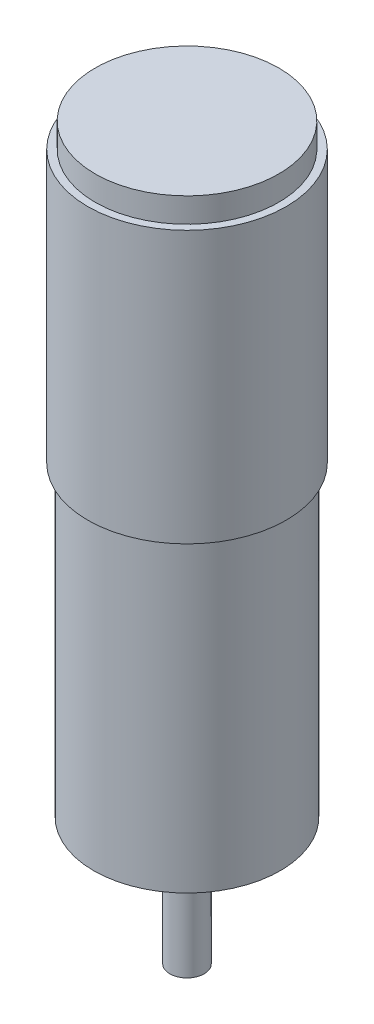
ISO-10303-21;
HEADER;
FILE_DESCRIPTION(('STEP AP214'),'2;1');
FILE_NAME('part.step','',(''),(''),'','','');
FILE_SCHEMA(('AUTOMOTIVE_DESIGN { 1 0 10303 214 1 1 1 1 }'));
ENDSEC;
DATA;
#1=APPLICATION_CONTEXT('core data for automotive mechanical design processes');
#2=APPLICATION_PROTOCOL_DEFINITION('international standard','automotive_design',2000,#1);
#3=PRODUCT_CONTEXT('',#1,'mechanical');
#4=PRODUCT('Part','Part','',(#3));
#5=PRODUCT_RELATED_PRODUCT_CATEGORY('part','',(#4));
#6=PRODUCT_DEFINITION_FORMATION('','',#4);
#7=PRODUCT_DEFINITION_CONTEXT('part definition',#1,'design');
#8=PRODUCT_DEFINITION('design','',#6,#7);
#9=PRODUCT_DEFINITION_SHAPE('','',#8);
#10=(LENGTH_UNIT() NAMED_UNIT(*) SI_UNIT(.MILLI.,.METRE.));
#11=(NAMED_UNIT(*) PLANE_ANGLE_UNIT() SI_UNIT($,.RADIAN.));
#12=(NAMED_UNIT(*) SI_UNIT($,.STERADIAN.) SOLID_ANGLE_UNIT());
#13=UNCERTAINTY_MEASURE_WITH_UNIT(LENGTH_MEASURE(1.E-05),#10,'distance_accuracy_value','');
#14=(GEOMETRIC_REPRESENTATION_CONTEXT(3) GLOBAL_UNCERTAINTY_ASSIGNED_CONTEXT((#13)) GLOBAL_UNIT_ASSIGNED_CONTEXT((#10,
#11,#12)) REPRESENTATION_CONTEXT('',''));
#15=CARTESIAN_POINT('',(0.,0.,0.));
#16=DIRECTION('',(0.,0.,1.));
#17=DIRECTION('',(1.,0.,0.));
#18=AXIS2_PLACEMENT_3D('',#15,#16,#17);
#19=CARTESIAN_POINT('',(0.,-2.032,0.));
#20=DIRECTION('',(0.,-1.,0.));
#21=DIRECTION('',(0.,0.,-1.));
#22=AXIS2_PLACEMENT_3D('',#19,#20,#21);
#23=PLANE('',#22);
#24=CARTESIAN_POINT('',(0.,-2.032,0.));
#25=DIRECTION('',(0.,-1.,0.));
#26=DIRECTION('',(0.,0.,-1.));
#27=AXIS2_PLACEMENT_3D('',#24,#25,#26);
#28=CIRCLE('',#27,2.4765);
#29=CARTESIAN_POINT('',(0.,-2.032,-2.4765));
#30=VERTEX_POINT('',#29);
#31=EDGE_CURVE('E66',#30,#30,#28,.T.);
#32=ORIENTED_EDGE('',*,*,#31,.T.);
#33=EDGE_LOOP('',(#32));
#34=FACE_BOUND('',#33,.T.);
#35=CARTESIAN_POINT('',(0.,-2.032,0.));
#36=DIRECTION('',(0.,-1.,0.));
#37=DIRECTION('',(0.,0.,-1.));
#38=AXIS2_PLACEMENT_3D('',#35,#36,#37);
#39=CIRCLE('',#38,1.4732);
#40=CARTESIAN_POINT('',(0.,-2.032,-1.4732));
#41=VERTEX_POINT('',#40);
#42=EDGE_CURVE('E75',#41,#41,#39,.T.);
#43=ORIENTED_EDGE('',*,*,#42,.F.);
#44=EDGE_LOOP('',(#43));
#45=FACE_BOUND('',#44,.T.);
#46=ADVANCED_FACE('F34',(#34,#45),#23,.T.);
#47=CARTESIAN_POINT('',(0.,-0.762,0.));
#48=DIRECTION('',(0.,-1.,0.));
#49=DIRECTION('',(0.,0.,-1.));
#50=AXIS2_PLACEMENT_3D('',#47,#48,#49);
#51=PLANE('',#50);
#52=CARTESIAN_POINT('',(0.,-0.762,0.));
#53=DIRECTION('',(0.,-1.,0.));
#54=DIRECTION('',(0.,0.,-1.));
#55=AXIS2_PLACEMENT_3D('',#52,#53,#54);
#56=CIRCLE('',#55,2.96545);
#57=CARTESIAN_POINT('',(0.,-0.762,2.96545));
#58=VERTEX_POINT('',#57);
#59=EDGE_CURVE('E63',#58,#58,#56,.T.);
#60=ORIENTED_EDGE('',*,*,#59,.T.);
#61=EDGE_LOOP('',(#60));
#62=FACE_BOUND('',#61,.T.);
#63=CARTESIAN_POINT('',(0.,-0.762,0.));
#64=DIRECTION('',(0.,-1.,0.));
#65=DIRECTION('',(0.,0.,-1.));
#66=AXIS2_PLACEMENT_3D('',#63,#64,#65);
#67=CIRCLE('',#66,2.4765);
#68=CARTESIAN_POINT('',(0.,-0.762,-2.4765));
#69=VERTEX_POINT('',#68);
#70=EDGE_CURVE('E69',#69,#69,#67,.T.);
#71=ORIENTED_EDGE('',*,*,#70,.F.);
#72=EDGE_LOOP('',(#71));
#73=FACE_BOUND('',#72,.T.);
#74=ADVANCED_FACE('F97',(#62,#73),#51,.T.);
#75=CARTESIAN_POINT('',(0.,0.,0.));
#76=DIRECTION('',(0.,1.,0.));
#77=DIRECTION('',(0.,0.,1.));
#78=AXIS2_PLACEMENT_3D('',#75,#76,#77);
#79=PLANE('',#78);
#80=CARTESIAN_POINT('',(0.,0.,-5.3975));
#81=DIRECTION('',(0.,-1.,0.));
#82=DIRECTION('',(0.,0.,-1.));
#83=AXIS2_PLACEMENT_3D('',#80,#81,#82);
#84=CIRCLE('',#83,0.9652);
#85=CARTESIAN_POINT('',(0.,0.,-6.3627));
#86=VERTEX_POINT('',#85);
#87=EDGE_CURVE('E87',#86,#86,#84,.T.);
#88=ORIENTED_EDGE('',*,*,#87,.F.);
#89=EDGE_LOOP('',(#88));
#90=FACE_BOUND('',#89,.T.);
#91=CARTESIAN_POINT('',(0.,0.,5.3975));
#92=DIRECTION('',(0.,-1.,0.));
#93=DIRECTION('',(0.,0.,-1.));
#94=AXIS2_PLACEMENT_3D('',#91,#92,#93);
#95=CIRCLE('',#94,0.9652);
#96=CARTESIAN_POINT('',(0.,0.,4.4323));
#97=VERTEX_POINT('',#96);
#98=EDGE_CURVE('E81',#97,#97,#95,.T.);
#99=ORIENTED_EDGE('',*,*,#98,.F.);
#100=EDGE_LOOP('',(#99));
#101=FACE_BOUND('',#100,.T.);
#102=CARTESIAN_POINT('',(0.,0.,0.));
#103=DIRECTION('',(0.,1.,0.));
#104=DIRECTION('',(0.,0.,1.));
#105=AXIS2_PLACEMENT_3D('',#102,#103,#104);
#106=CIRCLE('',#105,8.001);
#107=CARTESIAN_POINT('',(0.,0.,8.001));
#108=VERTEX_POINT('',#107);
#109=EDGE_CURVE('E45',#108,#108,#106,.T.);
#110=ORIENTED_EDGE('',*,*,#109,.F.);
#111=EDGE_LOOP('',(#110));
#112=FACE_BOUND('',#111,.T.);
#113=CARTESIAN_POINT('',(0.,0.,0.));
#114=DIRECTION('',(0.,1.,0.));
#115=DIRECTION('',(0.,0.,1.));
#116=AXIS2_PLACEMENT_3D('',#113,#114,#115);
#117=CIRCLE('',#116,2.96545);
#118=CARTESIAN_POINT('',(0.,0.,2.96545));
#119=VERTEX_POINT('',#118);
#120=EDGE_CURVE('E10',#119,#119,#117,.F.);
#121=ORIENTED_EDGE('',*,*,#120,.F.);
#122=EDGE_LOOP('',(#121));
#123=FACE_BOUND('',#122,.T.);
#124=ADVANCED_FACE('F93',(#90,#101,#112,#123),#79,.F.);
#125=CARTESIAN_POINT('',(0.,51.689,0.));
#126=DIRECTION('',(0.,-1.,0.));
#127=DIRECTION('',(0.,0.,-1.));
#128=AXIS2_PLACEMENT_3D('',#125,#126,#127);
#129=CYLINDRICAL_SURFACE('',#128,8.509);
#130=CARTESIAN_POINT('',(0.,26.289,0.));
#131=DIRECTION('',(0.,1.,0.));
#132=DIRECTION('',(0.,0.,1.));
#133=AXIS2_PLACEMENT_3D('',#130,#131,#132);
#134=CIRCLE('',#133,8.509);
#135=CARTESIAN_POINT('',(0.,26.289,8.509));
#136=VERTEX_POINT('',#135);
#137=EDGE_CURVE('E49',#136,#136,#134,.T.);
#138=ORIENTED_EDGE('',*,*,#137,.T.);
#139=EDGE_LOOP('',(#138));
#140=FACE_BOUND('',#139,.T.);
#141=CARTESIAN_POINT('',(0.,49.5808,0.));
#142=DIRECTION('',(0.,1.,0.));
#143=DIRECTION('',(0.,0.,1.));
#144=AXIS2_PLACEMENT_3D('',#141,#142,#143);
#145=CIRCLE('',#144,8.509);
#146=CARTESIAN_POINT('',(0.,49.5808,8.509));
#147=VERTEX_POINT('',#146);
#148=EDGE_CURVE('E54',#147,#147,#145,.T.);
#149=ORIENTED_EDGE('',*,*,#148,.F.);
#150=EDGE_LOOP('',(#149));
#151=FACE_BOUND('',#150,.T.);
#152=ADVANCED_FACE('F96',(#140,#151),#129,.T.);
#153=CARTESIAN_POINT('',(0.,26.289,0.));
#154=DIRECTION('',(0.,-1.,0.));
#155=DIRECTION('',(0.,0.,-1.));
#156=AXIS2_PLACEMENT_3D('',#153,#154,#155);
#157=CYLINDRICAL_SURFACE('',#156,8.001);
#158=CARTESIAN_POINT('',(0.,26.289,0.));
#159=DIRECTION('',(0.,1.,0.));
#160=DIRECTION('',(0.,0.,1.));
#161=AXIS2_PLACEMENT_3D('',#158,#159,#160);
#162=CIRCLE('',#161,8.001);
#163=CARTESIAN_POINT('',(0.,26.289,8.001));
#164=VERTEX_POINT('',#163);
#165=EDGE_CURVE('E41',#164,#164,#162,.T.);
#166=ORIENTED_EDGE('',*,*,#165,.F.);
#167=EDGE_LOOP('',(#166));
#168=FACE_BOUND('',#167,.T.);
#169=ORIENTED_EDGE('',*,*,#109,.T.);
#170=EDGE_LOOP('',(#169));
#171=FACE_BOUND('',#170,.T.);
#172=ADVANCED_FACE('F36',(#168,#171),#157,.T.);
#173=CARTESIAN_POINT('',(0.,26.289,0.));
#174=DIRECTION('',(0.,1.,0.));
#175=DIRECTION('',(0.,0.,1.));
#176=AXIS2_PLACEMENT_3D('',#173,#174,#175);
#177=PLANE('',#176);
#178=ORIENTED_EDGE('',*,*,#137,.F.);
#179=EDGE_LOOP('',(#178));
#180=FACE_BOUND('',#179,.T.);
#181=ORIENTED_EDGE('',*,*,#165,.T.);
#182=EDGE_LOOP('',(#181));
#183=FACE_BOUND('',#182,.T.);
#184=ADVANCED_FACE('F104',(#180,#183),#177,.F.);
#185=CARTESIAN_POINT('',(0.,49.5808,0.));
#186=DIRECTION('',(0.,1.,0.));
#187=DIRECTION('',(0.,0.,1.));
#188=AXIS2_PLACEMENT_3D('',#185,#186,#187);
#189=PLANE('',#188);
#190=CARTESIAN_POINT('',(0.,49.5808,0.));
#191=DIRECTION('',(0.,1.,0.));
#192=DIRECTION('',(0.,0.,1.));
#193=AXIS2_PLACEMENT_3D('',#190,#191,#192);
#194=CIRCLE('',#193,7.874);
#195=CARTESIAN_POINT('',(0.,49.5808,7.874));
#196=VERTEX_POINT('',#195);
#197=EDGE_CURVE('E57',#196,#196,#194,.T.);
#198=ORIENTED_EDGE('',*,*,#197,.F.);
#199=EDGE_LOOP('',(#198));
#200=FACE_BOUND('',#199,.T.);
#201=ORIENTED_EDGE('',*,*,#148,.T.);
#202=EDGE_LOOP('',(#201));
#203=FACE_BOUND('',#202,.T.);
#204=ADVANCED_FACE('F110',(#200,#203),#189,.T.);
#205=CARTESIAN_POINT('',(0.,49.5808,0.));
#206=DIRECTION('',(0.,1.,0.));
#207=DIRECTION('',(0.,0.,1.));
#208=AXIS2_PLACEMENT_3D('',#205,#206,#207);
#209=CYLINDRICAL_SURFACE('',#208,7.874);
#210=ORIENTED_EDGE('',*,*,#197,.T.);
#211=EDGE_LOOP('',(#210));
#212=FACE_BOUND('',#211,.T.);
#213=CARTESIAN_POINT('',(0.,51.689,0.));
#214=DIRECTION('',(0.,1.,0.));
#215=DIRECTION('',(0.,0.,1.));
#216=AXIS2_PLACEMENT_3D('',#213,#214,#215);
#217=CIRCLE('',#216,7.874);
#218=CARTESIAN_POINT('',(0.,51.689,7.874));
#219=VERTEX_POINT('',#218);
#220=EDGE_CURVE('E60',#219,#219,#217,.T.);
#221=ORIENTED_EDGE('',*,*,#220,.F.);
#222=EDGE_LOOP('',(#221));
#223=FACE_BOUND('',#222,.T.);
#224=ADVANCED_FACE('F137',(#212,#223),#209,.T.);
#225=CARTESIAN_POINT('',(0.,51.689,0.));
#226=DIRECTION('',(0.,1.,0.));
#227=DIRECTION('',(0.,0.,1.));
#228=AXIS2_PLACEMENT_3D('',#225,#226,#227);
#229=PLANE('',#228);
#230=ORIENTED_EDGE('',*,*,#220,.T.);
#231=EDGE_LOOP('',(#230));
#232=FACE_BOUND('',#231,.T.);
#233=ADVANCED_FACE('F135',(#232),#229,.T.);
#234=CARTESIAN_POINT('',(0.,-0.762,0.));
#235=DIRECTION('',(0.,1.,0.));
#236=DIRECTION('',(0.,0.,1.));
#237=AXIS2_PLACEMENT_3D('',#234,#235,#236);
#238=CYLINDRICAL_SURFACE('',#237,2.96545);
#239=CARTESIAN_POINT('',(0.,-0.762,2.96545));
#240=CARTESIAN_POINT('',(0.,-0.7540625,2.96545));
#241=CARTESIAN_POINT('',(0.,-0.746125,2.96545));
#242=CARTESIAN_POINT('',(0.,-0.73025,2.96545));
#243=CARTESIAN_POINT('',(0.,-0.7223125,2.96545));
#244=CARTESIAN_POINT('',(0.,-0.7064375,2.96545));
#245=CARTESIAN_POINT('',(0.,-0.6985,2.96545));
#246=CARTESIAN_POINT('',(0.,-0.682625,2.96545));
#247=CARTESIAN_POINT('',(0.,-0.6746875,2.96545));
#248=CARTESIAN_POINT('',(0.,-0.6588125,2.96545));
#249=CARTESIAN_POINT('',(0.,-0.650875,2.96545));
#250=CARTESIAN_POINT('',(0.,-0.635,2.96545));
#251=CARTESIAN_POINT('',(0.,-0.6270625,2.96545));
#252=CARTESIAN_POINT('',(0.,-0.6111875,2.96545));
#253=CARTESIAN_POINT('',(0.,-0.60325,2.96545));
#254=CARTESIAN_POINT('',(0.,-0.587375,2.96545));
#255=CARTESIAN_POINT('',(0.,-0.5794375,2.96545));
#256=CARTESIAN_POINT('',(0.,-0.5635625,2.96545));
#257=CARTESIAN_POINT('',(0.,-0.555625,2.96545));
#258=CARTESIAN_POINT('',(0.,-0.53975,2.96545));
#259=CARTESIAN_POINT('',(0.,-0.5318125,2.96545));
#260=CARTESIAN_POINT('',(0.,-0.5159375,2.96545));
#261=CARTESIAN_POINT('',(0.,-0.508,2.96545));
#262=CARTESIAN_POINT('',(0.,-0.492125,2.96545));
#263=CARTESIAN_POINT('',(0.,-0.4841875,2.96545));
#264=CARTESIAN_POINT('',(0.,-0.4683125,2.96545));
#265=CARTESIAN_POINT('',(0.,-0.460375,2.96545));
#266=CARTESIAN_POINT('',(0.,-0.4445,2.96545));
#267=CARTESIAN_POINT('',(0.,-0.4365625,2.96545));
#268=CARTESIAN_POINT('',(0.,-0.4206875,2.96545));
#269=CARTESIAN_POINT('',(0.,-0.41275,2.96545));
#270=CARTESIAN_POINT('',(0.,-0.396875,2.96545));
#271=CARTESIAN_POINT('',(0.,-0.3889375,2.96545));
#272=CARTESIAN_POINT('',(0.,-0.3730625,2.96545));
#273=CARTESIAN_POINT('',(0.,-0.365125,2.96545));
#274=CARTESIAN_POINT('',(0.,-0.34925,2.96545));
#275=CARTESIAN_POINT('',(0.,-0.3413125,2.96545));
#276=CARTESIAN_POINT('',(0.,-0.3254375,2.96545));
#277=CARTESIAN_POINT('',(0.,-0.3175,2.96545));
#278=CARTESIAN_POINT('',(0.,-0.301625,2.96545));
#279=CARTESIAN_POINT('',(0.,-0.2936875,2.96545));
#280=CARTESIAN_POINT('',(0.,-0.2778125,2.96545));
#281=CARTESIAN_POINT('',(0.,-0.269875,2.96545));
#282=CARTESIAN_POINT('',(0.,-0.254,2.96545));
#283=CARTESIAN_POINT('',(0.,-0.2460625,2.96545));
#284=CARTESIAN_POINT('',(0.,-0.2301875,2.96545));
#285=CARTESIAN_POINT('',(0.,-0.22225,2.96545));
#286=CARTESIAN_POINT('',(0.,-0.206375,2.96545));
#287=CARTESIAN_POINT('',(0.,-0.1984375,2.96545));
#288=CARTESIAN_POINT('',(0.,-0.1825625,2.96545));
#289=CARTESIAN_POINT('',(0.,-0.174625,2.96545));
#290=CARTESIAN_POINT('',(0.,-0.15875,2.96545));
#291=CARTESIAN_POINT('',(0.,-0.1508125,2.96545));
#292=CARTESIAN_POINT('',(0.,-0.1349375,2.96545));
#293=CARTESIAN_POINT('',(0.,-0.127,2.96545));
#294=CARTESIAN_POINT('',(0.,-0.111125,2.96545));
#295=CARTESIAN_POINT('',(0.,-0.1031875,2.96545));
#296=CARTESIAN_POINT('',(0.,-0.0873125,2.96545));
#297=CARTESIAN_POINT('',(0.,-0.079375,2.96545));
#298=CARTESIAN_POINT('',(0.,-0.0635,2.96545));
#299=CARTESIAN_POINT('',(0.,-0.0555625,2.96545));
#300=CARTESIAN_POINT('',(0.,-0.0396875,2.96545));
#301=CARTESIAN_POINT('',(0.,-0.03175,2.96545));
#302=CARTESIAN_POINT('',(0.,-0.015875,2.96545));
#303=CARTESIAN_POINT('',(0.,-0.00793749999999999,2.96545));
#304=CARTESIAN_POINT('',(0.,0.,2.96545));
#305=B_SPLINE_CURVE_WITH_KNOTS('',3,(#239,#240,#241,#242,#243,#244,#245,#246,#247,#248,#249,
#250,#251,#252,#253,#254,#255,#256,#257,#258,#259,#260,#261,#262,#263,#264,#265,#266,#267,#268,
#269,#270,#271,#272,#273,#274,#275,#276,#277,#278,#279,#280,#281,#282,#283,#284,#285,#286,#287,
#288,#289,#290,#291,#292,#293,#294,#295,#296,#297,#298,#299,#300,#301,#302,#303,#304),
.UNSPECIFIED.,.F.,.F.,(4,2,2,2,2,2,2,2,2,2,2,2,2,2,2,2,2,2,2,2,2,2,2,2,2,2,2,2,2,2,2,2,4),(0.,
0.0238125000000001,0.047625,0.0714375,0.0952500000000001,0.1190625,0.142875,0.1666875,0.1905,
0.2143125,0.238125,0.2619375,0.28575,0.3095625,0.333375,0.3571875,0.381,0.4048125,0.428625,
0.4524375,0.47625,0.5000625,0.523875,0.5476875,0.5715,0.5953125,0.619125,0.6429375,0.66675,
0.6905625,0.714375,0.7381875,0.762),.UNSPECIFIED.);
#306=EDGE_CURVE('BSEAM130',#58,#119,#305,.T.);
#307=ORIENTED_EDGE('',*,*,#59,.F.);
#308=ORIENTED_EDGE('',*,*,#120,.T.);
#309=ORIENTED_EDGE('',*,*,#306,.T.);
#310=ORIENTED_EDGE('',*,*,#306,.F.);
#311=EDGE_LOOP('',(#307,#309,#308,#310));
#312=FACE_BOUND('',#311,.T.);
#313=ADVANCED_FACE('F130',(#312),#238,.T.);
#314=CARTESIAN_POINT('',(0.,-2.032,0.));
#315=DIRECTION('',(0.,1.,0.));
#316=DIRECTION('',(0.,0.,1.));
#317=AXIS2_PLACEMENT_3D('',#314,#315,#316);
#318=CYLINDRICAL_SURFACE('',#317,2.4765);
#319=ORIENTED_EDGE('',*,*,#31,.F.);
#320=EDGE_LOOP('',(#319));
#321=FACE_BOUND('',#320,.T.);
#322=ORIENTED_EDGE('',*,*,#70,.T.);
#323=EDGE_LOOP('',(#322));
#324=FACE_BOUND('',#323,.T.);
#325=ADVANCED_FACE('F128',(#321,#324),#318,.T.);
#326=CARTESIAN_POINT('',(0.,-10.922,0.));
#327=DIRECTION('',(0.,1.,0.));
#328=DIRECTION('',(0.,0.,1.));
#329=AXIS2_PLACEMENT_3D('',#326,#327,#328);
#330=CYLINDRICAL_SURFACE('',#329,1.4732);
#331=CARTESIAN_POINT('',(0.,-10.922,0.));
#332=DIRECTION('',(0.,-1.,0.));
#333=DIRECTION('',(0.,0.,-1.));
#334=AXIS2_PLACEMENT_3D('',#331,#332,#333);
#335=CIRCLE('',#334,1.4732);
#336=CARTESIAN_POINT('',(0.,-10.922,-1.4732));
#337=VERTEX_POINT('',#336);
#338=EDGE_CURVE('E72',#337,#337,#335,.T.);
#339=ORIENTED_EDGE('',*,*,#338,.F.);
#340=EDGE_LOOP('',(#339));
#341=FACE_BOUND('',#340,.T.);
#342=ORIENTED_EDGE('',*,*,#42,.T.);
#343=EDGE_LOOP('',(#342));
#344=FACE_BOUND('',#343,.T.);
#345=ADVANCED_FACE('F126',(#341,#344),#330,.T.);
#346=CARTESIAN_POINT('',(0.,-10.922,0.));
#347=DIRECTION('',(0.,-1.,0.));
#348=DIRECTION('',(0.,0.,-1.));
#349=AXIS2_PLACEMENT_3D('',#346,#347,#348);
#350=PLANE('',#349);
#351=ORIENTED_EDGE('',*,*,#338,.T.);
#352=EDGE_LOOP('',(#351));
#353=FACE_BOUND('',#352,.T.);
#354=ADVANCED_FACE('F168',(#353),#350,.T.);
#355=CARTESIAN_POINT('',(0.,2.032,5.3975));
#356=DIRECTION('',(0.,-1.,0.));
#357=DIRECTION('',(0.,0.,-1.));
#358=AXIS2_PLACEMENT_3D('',#355,#356,#357);
#359=CYLINDRICAL_SURFACE('',#358,0.9652);
#360=CARTESIAN_POINT('',(0.,2.032,5.3975));
#361=DIRECTION('',(0.,-1.,0.));
#362=DIRECTION('',(0.,0.,-1.));
#363=AXIS2_PLACEMENT_3D('',#360,#361,#362);
#364=CIRCLE('',#363,0.9652);
#365=CARTESIAN_POINT('',(0.,2.032,4.4323));
#366=VERTEX_POINT('',#365);
#367=EDGE_CURVE('E78',#366,#366,#364,.T.);
#368=ORIENTED_EDGE('',*,*,#367,.F.);
#369=EDGE_LOOP('',(#368));
#370=FACE_BOUND('',#369,.T.);
#371=ORIENTED_EDGE('',*,*,#98,.T.);
#372=EDGE_LOOP('',(#371));
#373=FACE_BOUND('',#372,.T.);
#374=ADVANCED_FACE('F174',(#370,#373),#359,.F.);
#375=CARTESIAN_POINT('',(0.,2.032,5.3975));
#376=DIRECTION('',(0.,-1.,0.));
#377=DIRECTION('',(0.,0.,-1.));
#378=AXIS2_PLACEMENT_3D('',#375,#376,#377);
#379=PLANE('',#378);
#380=ORIENTED_EDGE('',*,*,#367,.T.);
#381=EDGE_LOOP('',(#380));
#382=FACE_BOUND('',#381,.T.);
#383=ADVANCED_FACE('F181',(#382),#379,.T.);
#384=CARTESIAN_POINT('',(0.,2.032,-5.3975));
#385=DIRECTION('',(0.,-1.,0.));
#386=DIRECTION('',(0.,0.,-1.));
#387=AXIS2_PLACEMENT_3D('',#384,#385,#386);
#388=CYLINDRICAL_SURFACE('',#387,0.9652);
#389=CARTESIAN_POINT('',(0.,2.032,-5.3975));
#390=DIRECTION('',(0.,-1.,0.));
#391=DIRECTION('',(0.,0.,-1.));
#392=AXIS2_PLACEMENT_3D('',#389,#390,#391);
#393=CIRCLE('',#392,0.9652);
#394=CARTESIAN_POINT('',(0.,2.032,-6.3627));
#395=VERTEX_POINT('',#394);
#396=EDGE_CURVE('E84',#395,#395,#393,.T.);
#397=ORIENTED_EDGE('',*,*,#396,.F.);
#398=EDGE_LOOP('',(#397));
#399=FACE_BOUND('',#398,.T.);
#400=ORIENTED_EDGE('',*,*,#87,.T.);
#401=EDGE_LOOP('',(#400));
#402=FACE_BOUND('',#401,.T.);
#403=ADVANCED_FACE('F91',(#399,#402),#388,.F.);
#404=CARTESIAN_POINT('',(0.,2.032,-5.3975));
#405=DIRECTION('',(0.,-1.,0.));
#406=DIRECTION('',(0.,0.,-1.));
#407=AXIS2_PLACEMENT_3D('',#404,#405,#406);
#408=PLANE('',#407);
#409=ORIENTED_EDGE('',*,*,#396,.T.);
#410=EDGE_LOOP('',(#409));
#411=FACE_BOUND('',#410,.T.);
#412=ADVANCED_FACE('F197',(#411),#408,.T.);
#413=CLOSED_SHELL('',(#46,#74,#124,#152,#172,#184,#204,#224,#233,#313,#325,#345,#354,#374,#383,
#403,#412));
#414=MANIFOLD_SOLID_BREP('B2',#413);
#415=ADVANCED_BREP_SHAPE_REPRESENTATION('',(#18,#414),#14);
#416=SHAPE_DEFINITION_REPRESENTATION(#9,#415);
ENDSEC;
END-ISO-10303-21;
